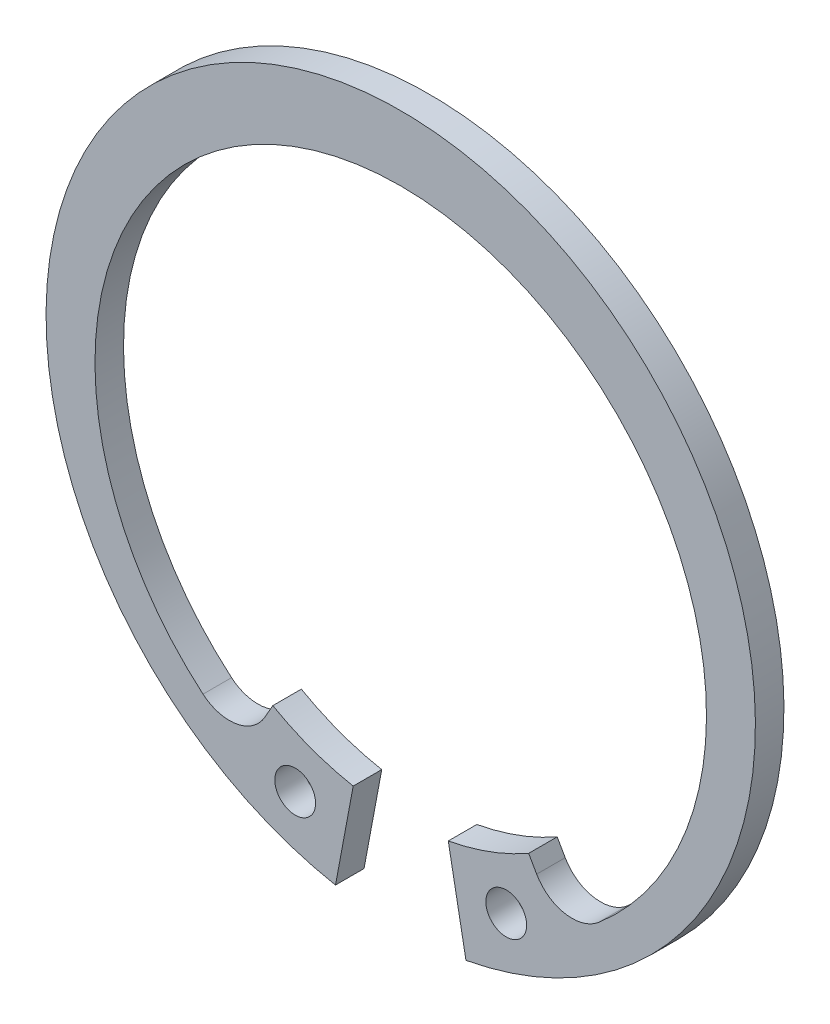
ISO-10303-21;
HEADER;
FILE_DESCRIPTION(('STEP AP214'),'2;1');
FILE_NAME('part.step','',(''),(''),'','','');
FILE_SCHEMA(('AUTOMOTIVE_DESIGN { 1 0 10303 214 1 1 1 1 }'));
ENDSEC;
DATA;
#1=APPLICATION_CONTEXT('core data for automotive mechanical design processes');
#2=APPLICATION_PROTOCOL_DEFINITION('international standard','automotive_design',2000,#1);
#3=PRODUCT_CONTEXT('',#1,'mechanical');
#4=PRODUCT('Part','Part','',(#3));
#5=PRODUCT_RELATED_PRODUCT_CATEGORY('part','',(#4));
#6=PRODUCT_DEFINITION_FORMATION('','',#4);
#7=PRODUCT_DEFINITION_CONTEXT('part definition',#1,'design');
#8=PRODUCT_DEFINITION('design','',#6,#7);
#9=PRODUCT_DEFINITION_SHAPE('','',#8);
#10=(LENGTH_UNIT() NAMED_UNIT(*) SI_UNIT(.MILLI.,.METRE.));
#11=(NAMED_UNIT(*) PLANE_ANGLE_UNIT() SI_UNIT($,.RADIAN.));
#12=(NAMED_UNIT(*) SI_UNIT($,.STERADIAN.) SOLID_ANGLE_UNIT());
#13=UNCERTAINTY_MEASURE_WITH_UNIT(LENGTH_MEASURE(1.E-05),#10,'distance_accuracy_value','');
#14=(GEOMETRIC_REPRESENTATION_CONTEXT(3) GLOBAL_UNCERTAINTY_ASSIGNED_CONTEXT((#13)) GLOBAL_UNIT_ASSIGNED_CONTEXT((#10,
#11,#12)) REPRESENTATION_CONTEXT('',''));
#15=CARTESIAN_POINT('',(0.,0.,0.));
#16=DIRECTION('',(0.,0.,1.));
#17=DIRECTION('',(1.,0.,0.));
#18=AXIS2_PLACEMENT_3D('',#15,#16,#17);
#19=CARTESIAN_POINT('',(0.,0.,0.));
#20=DIRECTION('',(0.,0.,1.));
#21=DIRECTION('',(1.,0.,0.));
#22=AXIS2_PLACEMENT_3D('',#19,#20,#21);
#23=PLANE('',#22);
#24=DIRECTION('',(0.183908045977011,-0.98294345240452,0.));
#25=VECTOR('',#24,1.);
#26=CARTESIAN_POINT('',(2.91494252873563,-15.5796537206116,0.));
#27=LINE('',#26,#25);
#28=CARTESIAN_POINT('',(2.91494252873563,-15.5796537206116,0.));
#29=VERTEX_POINT('',#28);
#30=CARTESIAN_POINT('',(4.,-21.3790200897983,0.));
#31=VERTEX_POINT('',#30);
#32=EDGE_CURVE('E457',#29,#31,#27,.T.);
#33=ORIENTED_EDGE('',*,*,#32,.F.);
#34=CARTESIAN_POINT('',(0.,-1.33573707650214E-13,0.));
#35=DIRECTION('',(0.,0.,1.));
#36=DIRECTION('',(1.,0.,0.));
#37=AXIS2_PLACEMENT_3D('',#34,#35,#36);
#38=CIRCLE('',#37,15.85);
#39=CARTESIAN_POINT('',(7.84515433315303,-13.7722929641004,0.));
#40=VERTEX_POINT('',#39);
#41=EDGE_CURVE('E20',#29,#40,#38,.T.);
#42=ORIENTED_EDGE('',*,*,#41,.T.);
#43=DIRECTION('',(-0.494962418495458,0.868914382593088,0.));
#44=VECTOR('',#43,1.);
#45=CARTESIAN_POINT('',(8.3354324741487,-14.6329840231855,0.));
#46=LINE('',#45,#44);
#47=CARTESIAN_POINT('',(8.3354324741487,-14.6329840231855,0.));
#48=VERTEX_POINT('',#47);
#49=EDGE_CURVE('E134',#48,#40,#46,.T.);
#50=ORIENTED_EDGE('',*,*,#49,.F.);
#51=CARTESIAN_POINT('',(10.5077184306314,-13.3955779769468,0.));
#52=DIRECTION('',(0.,0.,1.));
#53=DIRECTION('',(1.,0.,0.));
#54=AXIS2_PLACEMENT_3D('',#51,#52,#53);
#55=CIRCLE('',#54,2.5);
#56=CARTESIAN_POINT('',(12.1242904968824,-15.3025899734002,0.));
#57=VERTEX_POINT('',#56);
#58=EDGE_CURVE('E148',#48,#57,#55,.T.);
#59=ORIENTED_EDGE('',*,*,#58,.T.);
#60=CARTESIAN_POINT('',(0.,-1.,0.));
#61=DIRECTION('',(0.,0.,1.));
#62=DIRECTION('',(1.,0.,0.));
#63=AXIS2_PLACEMENT_3D('',#60,#61,#62);
#64=CIRCLE('',#63,18.75);
#65=CARTESIAN_POINT('',(-12.1242904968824,-15.3025899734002,0.));
#66=VERTEX_POINT('',#65);
#67=EDGE_CURVE('E152',#57,#66,#64,.T.);
#68=ORIENTED_EDGE('',*,*,#67,.T.);
#69=CARTESIAN_POINT('',(-10.5077184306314,-13.3955779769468,0.));
#70=DIRECTION('',(0.,0.,1.));
#71=DIRECTION('',(1.,0.,0.));
#72=AXIS2_PLACEMENT_3D('',#69,#70,#71);
#73=CIRCLE('',#72,2.5);
#74=CARTESIAN_POINT('',(-8.3354324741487,-14.6329840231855,0.));
#75=VERTEX_POINT('',#74);
#76=EDGE_CURVE('E224',#66,#75,#73,.T.);
#77=ORIENTED_EDGE('',*,*,#76,.T.);
#78=DIRECTION('',(-0.494962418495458,-0.868914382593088,0.));
#79=VECTOR('',#78,1.);
#80=CARTESIAN_POINT('',(-7.84515433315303,-13.7722929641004,0.));
#81=LINE('',#80,#79);
#82=CARTESIAN_POINT('',(-7.84515433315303,-13.7722929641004,0.));
#83=VERTEX_POINT('',#82);
#84=EDGE_CURVE('E215',#83,#75,#81,.T.);
#85=ORIENTED_EDGE('',*,*,#84,.F.);
#86=CARTESIAN_POINT('',(0.,-1.89084858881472E-13,0.));
#87=DIRECTION('',(0.,0.,1.));
#88=DIRECTION('',(1.,0.,0.));
#89=AXIS2_PLACEMENT_3D('',#86,#87,#88);
#90=CIRCLE('',#89,15.85);
#91=CARTESIAN_POINT('',(-2.91494252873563,-15.5796537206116,0.));
#92=VERTEX_POINT('',#91);
#93=EDGE_CURVE('E199',#83,#92,#90,.T.);
#94=ORIENTED_EDGE('',*,*,#93,.T.);
#95=DIRECTION('',(0.183908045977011,0.98294345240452,0.));
#96=VECTOR('',#95,1.);
#97=CARTESIAN_POINT('',(-4.,-21.3790200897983,0.));
#98=LINE('',#97,#96);
#99=CARTESIAN_POINT('',(-4.,-21.3790200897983,0.));
#100=VERTEX_POINT('',#99);
#101=EDGE_CURVE('E200',#100,#92,#98,.T.);
#102=ORIENTED_EDGE('',*,*,#101,.F.);
#103=CARTESIAN_POINT('',(0.,0.,0.));
#104=DIRECTION('',(0.,0.,1.));
#105=DIRECTION('',(1.,0.,0.));
#106=AXIS2_PLACEMENT_3D('',#103,#104,#105);
#107=CIRCLE('',#106,21.75);
#108=EDGE_CURVE('E187',#31,#100,#107,.T.);
#109=ORIENTED_EDGE('',*,*,#108,.F.);
#110=EDGE_LOOP('',(#33,#42,#50,#59,#68,#77,#85,#94,#102,#109));
#111=FACE_BOUND('',#110,.T.);
#112=CARTESIAN_POINT('',(6.47077686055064,-17.6513185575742,0.));
#113=DIRECTION('',(0.,0.,1.));
#114=DIRECTION('',(1.,0.,0.));
#115=AXIS2_PLACEMENT_3D('',#112,#113,#114);
#116=CIRCLE('',#115,1.25);
#117=CARTESIAN_POINT('',(7.72077686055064,-17.6513185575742,0.));
#118=VERTEX_POINT('',#117);
#119=EDGE_CURVE('E96',#118,#118,#116,.T.);
#120=ORIENTED_EDGE('',*,*,#119,.T.);
#121=EDGE_LOOP('',(#120));
#122=FACE_BOUND('',#121,.T.);
#123=CARTESIAN_POINT('',(-6.47077686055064,-17.6513185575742,0.));
#124=DIRECTION('',(0.,0.,1.));
#125=DIRECTION('',(1.,0.,0.));
#126=AXIS2_PLACEMENT_3D('',#123,#124,#125);
#127=CIRCLE('',#126,1.25);
#128=CARTESIAN_POINT('',(-5.22077686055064,-17.6513185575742,0.));
#129=VERTEX_POINT('',#128);
#130=EDGE_CURVE('E37',#129,#129,#127,.T.);
#131=ORIENTED_EDGE('',*,*,#130,.T.);
#132=EDGE_LOOP('',(#131));
#133=FACE_BOUND('',#132,.T.);
#134=ADVANCED_FACE('F17',(#111,#122,#133),#23,.F.);
#135=CARTESIAN_POINT('',(0.,0.,1.75));
#136=DIRECTION('',(0.,0.,1.));
#137=DIRECTION('',(1.,0.,0.));
#138=AXIS2_PLACEMENT_3D('',#135,#136,#137);
#139=PLANE('',#138);
#140=DIRECTION('',(0.183908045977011,-0.98294345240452,0.));
#141=VECTOR('',#140,1.);
#142=CARTESIAN_POINT('',(2.91494252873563,-15.5796537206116,1.75));
#143=LINE('',#142,#141);
#144=CARTESIAN_POINT('',(2.91494252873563,-15.5796537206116,1.75));
#145=VERTEX_POINT('',#144);
#146=CARTESIAN_POINT('',(4.,-21.3790200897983,1.75));
#147=VERTEX_POINT('',#146);
#148=EDGE_CURVE('E440',#145,#147,#143,.T.);
#149=ORIENTED_EDGE('',*,*,#148,.T.);
#150=CARTESIAN_POINT('',(0.,0.,1.75));
#151=DIRECTION('',(0.,0.,1.));
#152=DIRECTION('',(1.,0.,0.));
#153=AXIS2_PLACEMENT_3D('',#150,#151,#152);
#154=CIRCLE('',#153,21.75);
#155=CARTESIAN_POINT('',(-4.,-21.3790200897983,1.75));
#156=VERTEX_POINT('',#155);
#157=EDGE_CURVE('E193',#147,#156,#154,.T.);
#158=ORIENTED_EDGE('',*,*,#157,.T.);
#159=DIRECTION('',(0.183908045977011,0.98294345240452,0.));
#160=VECTOR('',#159,1.);
#161=CARTESIAN_POINT('',(-4.,-21.3790200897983,1.75));
#162=LINE('',#161,#160);
#163=CARTESIAN_POINT('',(-2.91494252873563,-15.5796537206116,1.75));
#164=VERTEX_POINT('',#163);
#165=EDGE_CURVE('E208',#156,#164,#162,.T.);
#166=ORIENTED_EDGE('',*,*,#165,.T.);
#167=CARTESIAN_POINT('',(0.,-1.89084858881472E-13,1.75));
#168=DIRECTION('',(0.,0.,1.));
#169=DIRECTION('',(1.,0.,0.));
#170=AXIS2_PLACEMENT_3D('',#167,#168,#169);
#171=CIRCLE('',#170,15.85);
#172=CARTESIAN_POINT('',(-7.84515433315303,-13.7722929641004,1.75));
#173=VERTEX_POINT('',#172);
#174=EDGE_CURVE('E198',#173,#164,#171,.T.);
#175=ORIENTED_EDGE('',*,*,#174,.F.);
#176=DIRECTION('',(-0.494962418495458,-0.868914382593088,0.));
#177=VECTOR('',#176,1.);
#178=CARTESIAN_POINT('',(-7.84515433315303,-13.7722929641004,1.75));
#179=LINE('',#178,#177);
#180=CARTESIAN_POINT('',(-8.3354324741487,-14.6329840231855,1.75));
#181=VERTEX_POINT('',#180);
#182=EDGE_CURVE('E223',#173,#181,#179,.T.);
#183=ORIENTED_EDGE('',*,*,#182,.T.);
#184=CARTESIAN_POINT('',(-10.5077184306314,-13.3955779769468,1.75));
#185=DIRECTION('',(0.,0.,1.));
#186=DIRECTION('',(1.,0.,0.));
#187=AXIS2_PLACEMENT_3D('',#184,#185,#186);
#188=CIRCLE('',#187,2.5);
#189=CARTESIAN_POINT('',(-12.1242904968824,-15.3025899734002,1.75));
#190=VERTEX_POINT('',#189);
#191=EDGE_CURVE('E143',#190,#181,#188,.T.);
#192=ORIENTED_EDGE('',*,*,#191,.F.);
#193=CARTESIAN_POINT('',(0.,-1.,1.75));
#194=DIRECTION('',(0.,0.,1.));
#195=DIRECTION('',(1.,0.,0.));
#196=AXIS2_PLACEMENT_3D('',#193,#194,#195);
#197=CIRCLE('',#196,18.75);
#198=CARTESIAN_POINT('',(12.1242904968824,-15.3025899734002,1.75));
#199=VERTEX_POINT('',#198);
#200=EDGE_CURVE('E137',#199,#190,#197,.T.);
#201=ORIENTED_EDGE('',*,*,#200,.F.);
#202=CARTESIAN_POINT('',(10.5077184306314,-13.3955779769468,1.75));
#203=DIRECTION('',(0.,0.,1.));
#204=DIRECTION('',(1.,0.,0.));
#205=AXIS2_PLACEMENT_3D('',#202,#203,#204);
#206=CIRCLE('',#205,2.5);
#207=CARTESIAN_POINT('',(8.3354324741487,-14.6329840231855,1.75));
#208=VERTEX_POINT('',#207);
#209=EDGE_CURVE('E122',#208,#199,#206,.T.);
#210=ORIENTED_EDGE('',*,*,#209,.F.);
#211=DIRECTION('',(-0.494962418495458,0.868914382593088,0.));
#212=VECTOR('',#211,1.);
#213=CARTESIAN_POINT('',(8.3354324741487,-14.6329840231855,1.75));
#214=LINE('',#213,#212);
#215=CARTESIAN_POINT('',(7.84515433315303,-13.7722929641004,1.75));
#216=VERTEX_POINT('',#215);
#217=EDGE_CURVE('E170',#208,#216,#214,.T.);
#218=ORIENTED_EDGE('',*,*,#217,.T.);
#219=CARTESIAN_POINT('',(0.,-1.33573707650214E-13,1.75));
#220=DIRECTION('',(0.,0.,1.));
#221=DIRECTION('',(1.,0.,0.));
#222=AXIS2_PLACEMENT_3D('',#219,#220,#221);
#223=CIRCLE('',#222,15.85);
#224=EDGE_CURVE('E11',#145,#216,#223,.T.);
#225=ORIENTED_EDGE('',*,*,#224,.F.);
#226=EDGE_LOOP('',(#149,#158,#166,#175,#183,#192,#201,#210,#218,#225));
#227=FACE_BOUND('',#226,.T.);
#228=CARTESIAN_POINT('',(6.47077686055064,-17.6513185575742,1.75));
#229=DIRECTION('',(0.,0.,1.));
#230=DIRECTION('',(1.,0.,0.));
#231=AXIS2_PLACEMENT_3D('',#228,#229,#230);
#232=CIRCLE('',#231,1.25);
#233=CARTESIAN_POINT('',(7.72077686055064,-17.6513185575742,1.75));
#234=VERTEX_POINT('',#233);
#235=EDGE_CURVE('E105',#234,#234,#232,.T.);
#236=ORIENTED_EDGE('',*,*,#235,.F.);
#237=EDGE_LOOP('',(#236));
#238=FACE_BOUND('',#237,.T.);
#239=CARTESIAN_POINT('',(-6.47077686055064,-17.6513185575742,1.75));
#240=DIRECTION('',(0.,0.,1.));
#241=DIRECTION('',(1.,0.,0.));
#242=AXIS2_PLACEMENT_3D('',#239,#240,#241);
#243=CIRCLE('',#242,1.25);
#244=CARTESIAN_POINT('',(-5.22077686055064,-17.6513185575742,1.75));
#245=VERTEX_POINT('',#244);
#246=EDGE_CURVE('E176',#245,#245,#243,.T.);
#247=ORIENTED_EDGE('',*,*,#246,.F.);
#248=EDGE_LOOP('',(#247));
#249=FACE_BOUND('',#248,.T.);
#250=ADVANCED_FACE('F139',(#227,#238,#249),#139,.T.);
#251=CARTESIAN_POINT('',(0.,-1.33573707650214E-13,1.75));
#252=DIRECTION('',(0.,0.,-1.));
#253=DIRECTION('',(-1.,0.,0.));
#254=AXIS2_PLACEMENT_3D('',#251,#252,#253);
#255=CYLINDRICAL_SURFACE('',#254,15.85);
#256=ORIENTED_EDGE('',*,*,#41,.F.);
#257=DIRECTION('',(0.,0.,-1.));
#258=VECTOR('',#257,1.);
#259=CARTESIAN_POINT('',(2.91494252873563,-15.5796537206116,1.75));
#260=LINE('',#259,#258);
#261=EDGE_CURVE('E428',#145,#29,#260,.T.);
#262=ORIENTED_EDGE('',*,*,#261,.F.);
#263=ORIENTED_EDGE('',*,*,#224,.T.);
#264=DIRECTION('',(0.,0.,-1.));
#265=VECTOR('',#264,1.);
#266=CARTESIAN_POINT('',(7.84515433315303,-13.7722929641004,1.75));
#267=LINE('',#266,#265);
#268=EDGE_CURVE('E166',#216,#40,#267,.T.);
#269=ORIENTED_EDGE('',*,*,#268,.T.);
#270=EDGE_LOOP('',(#256,#262,#263,#269));
#271=FACE_BOUND('',#270,.T.);
#272=ADVANCED_FACE('F278',(#271),#255,.F.);
#273=CARTESIAN_POINT('',(-6.47077686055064,-17.6513185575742,1.75));
#274=DIRECTION('',(0.,0.,-1.));
#275=DIRECTION('',(-1.,0.,0.));
#276=AXIS2_PLACEMENT_3D('',#273,#274,#275);
#277=CYLINDRICAL_SURFACE('',#276,1.25);
#278=ORIENTED_EDGE('',*,*,#130,.F.);
#279=EDGE_LOOP('',(#278));
#280=FACE_BOUND('',#279,.T.);
#281=ORIENTED_EDGE('',*,*,#246,.T.);
#282=EDGE_LOOP('',(#281));
#283=FACE_BOUND('',#282,.T.);
#284=ADVANCED_FACE('F272',(#280,#283),#277,.F.);
#285=CARTESIAN_POINT('',(6.47077686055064,-17.6513185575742,1.75));
#286=DIRECTION('',(0.,0.,-1.));
#287=DIRECTION('',(-1.,0.,0.));
#288=AXIS2_PLACEMENT_3D('',#285,#286,#287);
#289=CYLINDRICAL_SURFACE('',#288,1.25);
#290=ORIENTED_EDGE('',*,*,#119,.F.);
#291=EDGE_LOOP('',(#290));
#292=FACE_BOUND('',#291,.T.);
#293=ORIENTED_EDGE('',*,*,#235,.T.);
#294=EDGE_LOOP('',(#293));
#295=FACE_BOUND('',#294,.T.);
#296=ADVANCED_FACE('F277',(#292,#295),#289,.F.);
#297=CARTESIAN_POINT('',(8.3354324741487,-14.6329840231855,1.75));
#298=DIRECTION('',(-0.868914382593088,-0.494962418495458,0.));
#299=DIRECTION('',(-0.494962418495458,0.868914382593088,0.));
#300=AXIS2_PLACEMENT_3D('',#297,#298,#299);
#301=PLANE('',#300);
#302=ORIENTED_EDGE('',*,*,#49,.T.);
#303=ORIENTED_EDGE('',*,*,#268,.F.);
#304=ORIENTED_EDGE('',*,*,#217,.F.);
#305=DIRECTION('',(0.,0.,-1.));
#306=VECTOR('',#305,1.);
#307=CARTESIAN_POINT('',(8.3354324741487,-14.6329840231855,1.75));
#308=LINE('',#307,#306);
#309=EDGE_CURVE('E130',#208,#48,#308,.T.);
#310=ORIENTED_EDGE('',*,*,#309,.T.);
#311=EDGE_LOOP('',(#302,#303,#304,#310));
#312=FACE_BOUND('',#311,.T.);
#313=ADVANCED_FACE('F288',(#312),#301,.F.);
#314=CARTESIAN_POINT('',(10.5077184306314,-13.3955779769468,1.75));
#315=DIRECTION('',(0.,0.,-1.));
#316=DIRECTION('',(-1.,0.,0.));
#317=AXIS2_PLACEMENT_3D('',#314,#315,#316);
#318=CYLINDRICAL_SURFACE('',#317,2.5);
#319=ORIENTED_EDGE('',*,*,#58,.F.);
#320=ORIENTED_EDGE('',*,*,#309,.F.);
#321=ORIENTED_EDGE('',*,*,#209,.T.);
#322=DIRECTION('',(0.,0.,-1.));
#323=VECTOR('',#322,1.);
#324=CARTESIAN_POINT('',(12.1242904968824,-15.3025899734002,1.75));
#325=LINE('',#324,#323);
#326=EDGE_CURVE('E127',#199,#57,#325,.T.);
#327=ORIENTED_EDGE('',*,*,#326,.T.);
#328=EDGE_LOOP('',(#319,#320,#321,#327));
#329=FACE_BOUND('',#328,.T.);
#330=ADVANCED_FACE('F125',(#329),#318,.F.);
#331=CARTESIAN_POINT('',(0.,-1.,1.75));
#332=DIRECTION('',(0.,0.,-1.));
#333=DIRECTION('',(-1.,0.,0.));
#334=AXIS2_PLACEMENT_3D('',#331,#332,#333);
#335=CYLINDRICAL_SURFACE('',#334,18.75);
#336=ORIENTED_EDGE('',*,*,#67,.F.);
#337=ORIENTED_EDGE('',*,*,#326,.F.);
#338=ORIENTED_EDGE('',*,*,#200,.T.);
#339=DIRECTION('',(0.,0.,-1.));
#340=VECTOR('',#339,1.);
#341=CARTESIAN_POINT('',(-12.1242904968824,-15.3025899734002,1.75));
#342=LINE('',#341,#340);
#343=EDGE_CURVE('E227',#190,#66,#342,.T.);
#344=ORIENTED_EDGE('',*,*,#343,.T.);
#345=EDGE_LOOP('',(#336,#337,#338,#344));
#346=FACE_BOUND('',#345,.T.);
#347=ADVANCED_FACE('F150',(#346),#335,.F.);
#348=CARTESIAN_POINT('',(-10.5077184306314,-13.3955779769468,1.75));
#349=DIRECTION('',(0.,0.,-1.));
#350=DIRECTION('',(-1.,0.,0.));
#351=AXIS2_PLACEMENT_3D('',#348,#349,#350);
#352=CYLINDRICAL_SURFACE('',#351,2.5);
#353=ORIENTED_EDGE('',*,*,#76,.F.);
#354=ORIENTED_EDGE('',*,*,#343,.F.);
#355=ORIENTED_EDGE('',*,*,#191,.T.);
#356=DIRECTION('',(0.,0.,-1.));
#357=VECTOR('',#356,1.);
#358=CARTESIAN_POINT('',(-8.3354324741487,-14.6329840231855,1.75));
#359=LINE('',#358,#357);
#360=EDGE_CURVE('E218',#181,#75,#359,.T.);
#361=ORIENTED_EDGE('',*,*,#360,.T.);
#362=EDGE_LOOP('',(#353,#354,#355,#361));
#363=FACE_BOUND('',#362,.T.);
#364=ADVANCED_FACE('F233',(#363),#352,.F.);
#365=CARTESIAN_POINT('',(-7.84515433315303,-13.7722929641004,1.75));
#366=DIRECTION('',(0.868914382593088,-0.494962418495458,0.));
#367=DIRECTION('',(0.,0.,-1.));
#368=AXIS2_PLACEMENT_3D('',#365,#366,#367);
#369=PLANE('',#368);
#370=ORIENTED_EDGE('',*,*,#84,.T.);
#371=ORIENTED_EDGE('',*,*,#360,.F.);
#372=ORIENTED_EDGE('',*,*,#182,.F.);
#373=DIRECTION('',(0.,0.,-1.));
#374=VECTOR('',#373,1.);
#375=CARTESIAN_POINT('',(-7.84515433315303,-13.7722929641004,1.75));
#376=LINE('',#375,#374);
#377=EDGE_CURVE('E194',#173,#83,#376,.T.);
#378=ORIENTED_EDGE('',*,*,#377,.T.);
#379=EDGE_LOOP('',(#370,#371,#372,#378));
#380=FACE_BOUND('',#379,.T.);
#381=ADVANCED_FACE('F242',(#380),#369,.F.);
#382=CARTESIAN_POINT('',(0.,-1.89084858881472E-13,1.75));
#383=DIRECTION('',(0.,0.,-1.));
#384=DIRECTION('',(-1.,0.,0.));
#385=AXIS2_PLACEMENT_3D('',#382,#383,#384);
#386=CYLINDRICAL_SURFACE('',#385,15.85);
#387=ORIENTED_EDGE('',*,*,#93,.F.);
#388=ORIENTED_EDGE('',*,*,#377,.F.);
#389=ORIENTED_EDGE('',*,*,#174,.T.);
#390=DIRECTION('',(0.,0.,-1.));
#391=VECTOR('',#390,1.);
#392=CARTESIAN_POINT('',(-2.91494252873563,-15.5796537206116,1.75));
#393=LINE('',#392,#391);
#394=EDGE_CURVE('E204',#164,#92,#393,.T.);
#395=ORIENTED_EDGE('',*,*,#394,.T.);
#396=EDGE_LOOP('',(#387,#388,#389,#395));
#397=FACE_BOUND('',#396,.T.);
#398=ADVANCED_FACE('F318',(#397),#386,.F.);
#399=CARTESIAN_POINT('',(-4.,-21.3790200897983,1.75));
#400=DIRECTION('',(-0.98294345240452,0.183908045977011,0.));
#401=DIRECTION('',(0.,0.,1.));
#402=AXIS2_PLACEMENT_3D('',#399,#400,#401);
#403=PLANE('',#402);
#404=ORIENTED_EDGE('',*,*,#101,.T.);
#405=ORIENTED_EDGE('',*,*,#394,.F.);
#406=ORIENTED_EDGE('',*,*,#165,.F.);
#407=DIRECTION('',(0.,0.,-1.));
#408=VECTOR('',#407,1.);
#409=CARTESIAN_POINT('',(-4.,-21.3790200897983,1.75));
#410=LINE('',#409,#408);
#411=EDGE_CURVE('E189',#156,#100,#410,.T.);
#412=ORIENTED_EDGE('',*,*,#411,.T.);
#413=EDGE_LOOP('',(#404,#405,#406,#412));
#414=FACE_BOUND('',#413,.T.);
#415=ADVANCED_FACE('F326',(#414),#403,.F.);
#416=CARTESIAN_POINT('',(0.,0.,1.75));
#417=DIRECTION('',(0.,0.,-1.));
#418=DIRECTION('',(-1.,0.,0.));
#419=AXIS2_PLACEMENT_3D('',#416,#417,#418);
#420=CYLINDRICAL_SURFACE('',#419,21.75);
#421=ORIENTED_EDGE('',*,*,#108,.T.);
#422=ORIENTED_EDGE('',*,*,#411,.F.);
#423=ORIENTED_EDGE('',*,*,#157,.F.);
#424=DIRECTION('',(0.,0.,-1.));
#425=VECTOR('',#424,1.);
#426=CARTESIAN_POINT('',(4.,-21.3790200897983,1.75));
#427=LINE('',#426,#425);
#428=EDGE_CURVE('E445',#147,#31,#427,.T.);
#429=ORIENTED_EDGE('',*,*,#428,.T.);
#430=EDGE_LOOP('',(#421,#422,#423,#429));
#431=FACE_BOUND('',#430,.T.);
#432=ADVANCED_FACE('F342',(#431),#420,.T.);
#433=CARTESIAN_POINT('',(2.91494252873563,-15.5796537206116,1.75));
#434=DIRECTION('',(0.98294345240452,0.183908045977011,0.));
#435=DIRECTION('',(0.,0.,-1.));
#436=AXIS2_PLACEMENT_3D('',#433,#434,#435);
#437=PLANE('',#436);
#438=ORIENTED_EDGE('',*,*,#32,.T.);
#439=ORIENTED_EDGE('',*,*,#428,.F.);
#440=ORIENTED_EDGE('',*,*,#148,.F.);
#441=ORIENTED_EDGE('',*,*,#261,.T.);
#442=EDGE_LOOP('',(#438,#439,#440,#441));
#443=FACE_BOUND('',#442,.T.);
#444=ADVANCED_FACE('F357',(#443),#437,.F.);
#445=CLOSED_SHELL('',(#134,#250,#272,#284,#296,#313,#330,#347,#364,#381,#398,#415,#432,#444));
#446=MANIFOLD_SOLID_BREP('B1',#445);
#447=ADVANCED_BREP_SHAPE_REPRESENTATION('',(#18,#446),#14);
#448=SHAPE_DEFINITION_REPRESENTATION(#9,#447);
ENDSEC;
END-ISO-10303-21;
